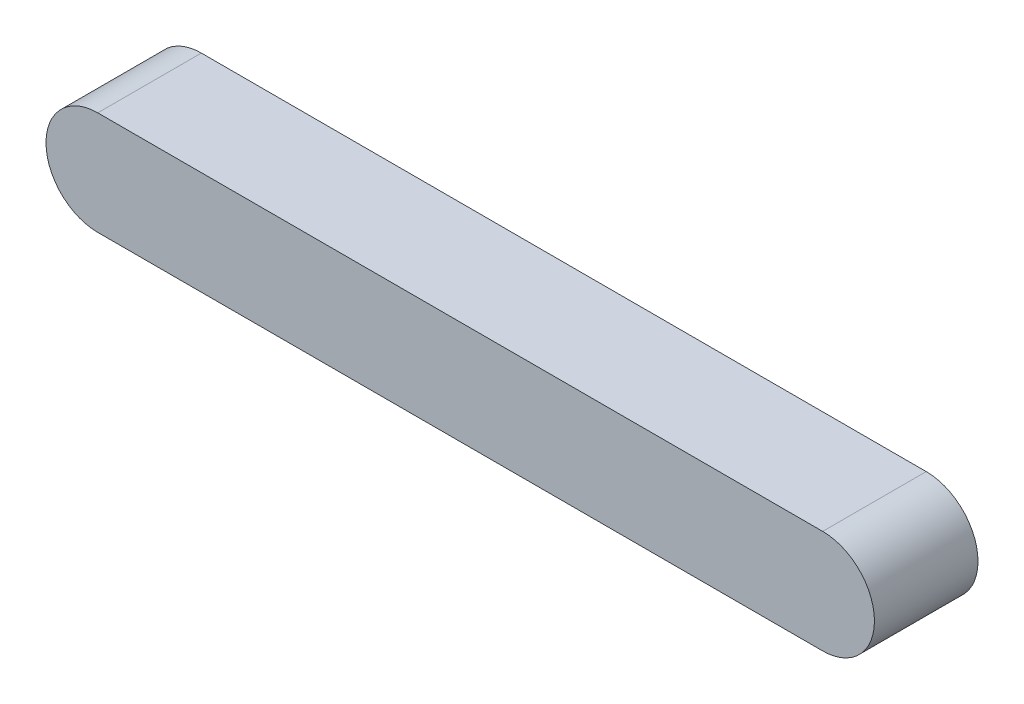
ISO-10303-21;
HEADER;
FILE_DESCRIPTION(('STEP AP214'),'2;1');
FILE_NAME('part.step','',(''),(''),'','','');
FILE_SCHEMA(('AUTOMOTIVE_DESIGN { 1 0 10303 214 1 1 1 1 }'));
ENDSEC;
DATA;
#1=APPLICATION_CONTEXT('core data for automotive mechanical design processes');
#2=APPLICATION_PROTOCOL_DEFINITION('international standard','automotive_design',2000,#1);
#3=PRODUCT_CONTEXT('',#1,'mechanical');
#4=PRODUCT('Part','Part','',(#3));
#5=PRODUCT_RELATED_PRODUCT_CATEGORY('part','',(#4));
#6=PRODUCT_DEFINITION_FORMATION('','',#4);
#7=PRODUCT_DEFINITION_CONTEXT('part definition',#1,'design');
#8=PRODUCT_DEFINITION('design','',#6,#7);
#9=PRODUCT_DEFINITION_SHAPE('','',#8);
#10=(LENGTH_UNIT() NAMED_UNIT(*) SI_UNIT(.MILLI.,.METRE.));
#11=(NAMED_UNIT(*) PLANE_ANGLE_UNIT() SI_UNIT($,.RADIAN.));
#12=(NAMED_UNIT(*) SI_UNIT($,.STERADIAN.) SOLID_ANGLE_UNIT());
#13=UNCERTAINTY_MEASURE_WITH_UNIT(LENGTH_MEASURE(1.E-05),#10,'distance_accuracy_value','');
#14=(GEOMETRIC_REPRESENTATION_CONTEXT(3) GLOBAL_UNCERTAINTY_ASSIGNED_CONTEXT((#13)) GLOBAL_UNIT_ASSIGNED_CONTEXT((#10,
#11,#12)) REPRESENTATION_CONTEXT('',''));
#15=CARTESIAN_POINT('',(0.,0.,0.));
#16=DIRECTION('',(0.,0.,1.));
#17=DIRECTION('',(1.,0.,0.));
#18=AXIS2_PLACEMENT_3D('',#15,#16,#17);
#19=CARTESIAN_POINT('',(0.,0.,0.));
#20=DIRECTION('',(0.,0.,1.));
#21=DIRECTION('',(1.,0.,0.));
#22=AXIS2_PLACEMENT_3D('',#19,#20,#21);
#23=PLANE('',#22);
#24=DIRECTION('',(1.,0.,0.));
#25=VECTOR('',#24,1.);
#26=CARTESIAN_POINT('',(-17.5,2.5,0.));
#27=LINE('',#26,#25);
#28=CARTESIAN_POINT('',(17.5,2.5,0.));
#29=VERTEX_POINT('',#28);
#30=CARTESIAN_POINT('',(-17.5,2.5,0.));
#31=VERTEX_POINT('',#30);
#32=EDGE_CURVE('E51',#29,#31,#27,.F.);
#33=ORIENTED_EDGE('',*,*,#32,.F.);
#34=CARTESIAN_POINT('',(17.5,0.,0.));
#35=DIRECTION('',(0.,0.,1.));
#36=DIRECTION('',(1.,0.,0.));
#37=AXIS2_PLACEMENT_3D('',#34,#35,#36);
#38=CIRCLE('',#37,2.5);
#39=CARTESIAN_POINT('',(17.5,-2.5,0.));
#40=VERTEX_POINT('',#39);
#41=EDGE_CURVE('E66',#40,#29,#38,.T.);
#42=ORIENTED_EDGE('',*,*,#41,.F.);
#43=DIRECTION('',(1.,0.,0.));
#44=VECTOR('',#43,1.);
#45=CARTESIAN_POINT('',(17.5,-2.5,0.));
#46=LINE('',#45,#44);
#47=CARTESIAN_POINT('',(-17.5,-2.5,0.));
#48=VERTEX_POINT('',#47);
#49=EDGE_CURVE('E64',#48,#40,#46,.T.);
#50=ORIENTED_EDGE('',*,*,#49,.F.);
#51=CARTESIAN_POINT('',(-17.5,0.,0.));
#52=DIRECTION('',(0.,0.,1.));
#53=DIRECTION('',(1.,0.,0.));
#54=AXIS2_PLACEMENT_3D('',#51,#52,#53);
#55=CIRCLE('',#54,2.5);
#56=EDGE_CURVE('E17',#31,#48,#55,.T.);
#57=ORIENTED_EDGE('',*,*,#56,.F.);
#58=EDGE_LOOP('',(#33,#42,#50,#57));
#59=FACE_BOUND('',#58,.T.);
#60=ADVANCED_FACE('F14',(#59),#23,.F.);
#61=CARTESIAN_POINT('',(-17.5,2.5,0.));
#62=DIRECTION('',(0.,1.,0.));
#63=DIRECTION('',(0.,0.,1.));
#64=AXIS2_PLACEMENT_3D('',#61,#62,#63);
#65=PLANE('',#64);
#66=ORIENTED_EDGE('',*,*,#32,.T.);
#67=DIRECTION('',(0.,0.,1.));
#68=VECTOR('',#67,1.);
#69=CARTESIAN_POINT('',(-17.5,2.5,0.));
#70=LINE('',#69,#68);
#71=CARTESIAN_POINT('',(-17.5,2.5,5.));
#72=VERTEX_POINT('',#71);
#73=EDGE_CURVE('E61',#72,#31,#70,.F.);
#74=ORIENTED_EDGE('',*,*,#73,.F.);
#75=DIRECTION('',(1.,0.,0.));
#76=VECTOR('',#75,1.);
#77=CARTESIAN_POINT('',(0.,2.5,5.));
#78=LINE('',#77,#76);
#79=CARTESIAN_POINT('',(17.5,2.5,5.));
#80=VERTEX_POINT('',#79);
#81=EDGE_CURVE('E78',#80,#72,#78,.F.);
#82=ORIENTED_EDGE('',*,*,#81,.F.);
#83=DIRECTION('',(0.,0.,1.));
#84=VECTOR('',#83,1.);
#85=CARTESIAN_POINT('',(17.5,2.5,0.));
#86=LINE('',#85,#84);
#87=EDGE_CURVE('E79',#29,#80,#86,.T.);
#88=ORIENTED_EDGE('',*,*,#87,.F.);
#89=EDGE_LOOP('',(#66,#74,#82,#88));
#90=FACE_BOUND('',#89,.T.);
#91=ADVANCED_FACE('F88',(#90),#65,.T.);
#92=CARTESIAN_POINT('',(-17.5,0.,0.));
#93=DIRECTION('',(0.,0.,1.));
#94=DIRECTION('',(1.,0.,0.));
#95=AXIS2_PLACEMENT_3D('',#92,#93,#94);
#96=CYLINDRICAL_SURFACE('',#95,2.5);
#97=ORIENTED_EDGE('',*,*,#56,.T.);
#98=DIRECTION('',(0.,0.,-1.));
#99=VECTOR('',#98,1.);
#100=CARTESIAN_POINT('',(-17.5,-2.5,0.));
#101=LINE('',#100,#99);
#102=CARTESIAN_POINT('',(-17.5,-2.5,5.));
#103=VERTEX_POINT('',#102);
#104=EDGE_CURVE('E60',#103,#48,#101,.T.);
#105=ORIENTED_EDGE('',*,*,#104,.F.);
#106=CARTESIAN_POINT('',(-17.5,0.,5.));
#107=DIRECTION('',(0.,0.,1.));
#108=DIRECTION('',(1.,0.,0.));
#109=AXIS2_PLACEMENT_3D('',#106,#107,#108);
#110=CIRCLE('',#109,2.5);
#111=EDGE_CURVE('E77',#72,#103,#110,.T.);
#112=ORIENTED_EDGE('',*,*,#111,.F.);
#113=ORIENTED_EDGE('',*,*,#73,.T.);
#114=EDGE_LOOP('',(#97,#105,#112,#113));
#115=FACE_BOUND('',#114,.T.);
#116=ADVANCED_FACE('F57',(#115),#96,.T.);
#117=CARTESIAN_POINT('',(17.5,-2.5,0.));
#118=DIRECTION('',(0.,-1.,0.));
#119=DIRECTION('',(0.,0.,-1.));
#120=AXIS2_PLACEMENT_3D('',#117,#118,#119);
#121=PLANE('',#120);
#122=ORIENTED_EDGE('',*,*,#49,.T.);
#123=DIRECTION('',(0.,0.,1.));
#124=VECTOR('',#123,1.);
#125=CARTESIAN_POINT('',(17.5,-2.5,0.));
#126=LINE('',#125,#124);
#127=CARTESIAN_POINT('',(17.5,-2.5,5.));
#128=VERTEX_POINT('',#127);
#129=EDGE_CURVE('E32',#128,#40,#126,.F.);
#130=ORIENTED_EDGE('',*,*,#129,.F.);
#131=DIRECTION('',(1.,0.,0.));
#132=VECTOR('',#131,1.);
#133=CARTESIAN_POINT('',(0.,-2.5,5.));
#134=LINE('',#133,#132);
#135=EDGE_CURVE('E23',#103,#128,#134,.T.);
#136=ORIENTED_EDGE('',*,*,#135,.F.);
#137=ORIENTED_EDGE('',*,*,#104,.T.);
#138=EDGE_LOOP('',(#122,#130,#136,#137));
#139=FACE_BOUND('',#138,.T.);
#140=ADVANCED_FACE('F68',(#139),#121,.T.);
#141=CARTESIAN_POINT('',(17.5,0.,0.));
#142=DIRECTION('',(0.,0.,1.));
#143=DIRECTION('',(1.,0.,0.));
#144=AXIS2_PLACEMENT_3D('',#141,#142,#143);
#145=CYLINDRICAL_SURFACE('',#144,2.5);
#146=ORIENTED_EDGE('',*,*,#41,.T.);
#147=ORIENTED_EDGE('',*,*,#87,.T.);
#148=CARTESIAN_POINT('',(17.5,0.,5.));
#149=DIRECTION('',(0.,0.,1.));
#150=DIRECTION('',(1.,0.,0.));
#151=AXIS2_PLACEMENT_3D('',#148,#149,#150);
#152=CIRCLE('',#151,2.5);
#153=EDGE_CURVE('E9',#128,#80,#152,.T.);
#154=ORIENTED_EDGE('',*,*,#153,.F.);
#155=ORIENTED_EDGE('',*,*,#129,.T.);
#156=EDGE_LOOP('',(#146,#147,#154,#155));
#157=FACE_BOUND('',#156,.T.);
#158=ADVANCED_FACE('F82',(#157),#145,.T.);
#159=CARTESIAN_POINT('',(0.,0.,5.));
#160=DIRECTION('',(0.,0.,1.));
#161=DIRECTION('',(1.,0.,0.));
#162=AXIS2_PLACEMENT_3D('',#159,#160,#161);
#163=PLANE('',#162);
#164=ORIENTED_EDGE('',*,*,#135,.T.);
#165=ORIENTED_EDGE('',*,*,#153,.T.);
#166=ORIENTED_EDGE('',*,*,#81,.T.);
#167=ORIENTED_EDGE('',*,*,#111,.T.);
#168=EDGE_LOOP('',(#164,#165,#166,#167));
#169=FACE_BOUND('',#168,.T.);
#170=ADVANCED_FACE('F85',(#169),#163,.T.);
#171=CLOSED_SHELL('',(#60,#91,#116,#140,#158,#170));
#172=MANIFOLD_SOLID_BREP('B1',#171);
#173=ADVANCED_BREP_SHAPE_REPRESENTATION('',(#18,#172),#14);
#174=SHAPE_DEFINITION_REPRESENTATION(#9,#173);
ENDSEC;
END-ISO-10303-21;
